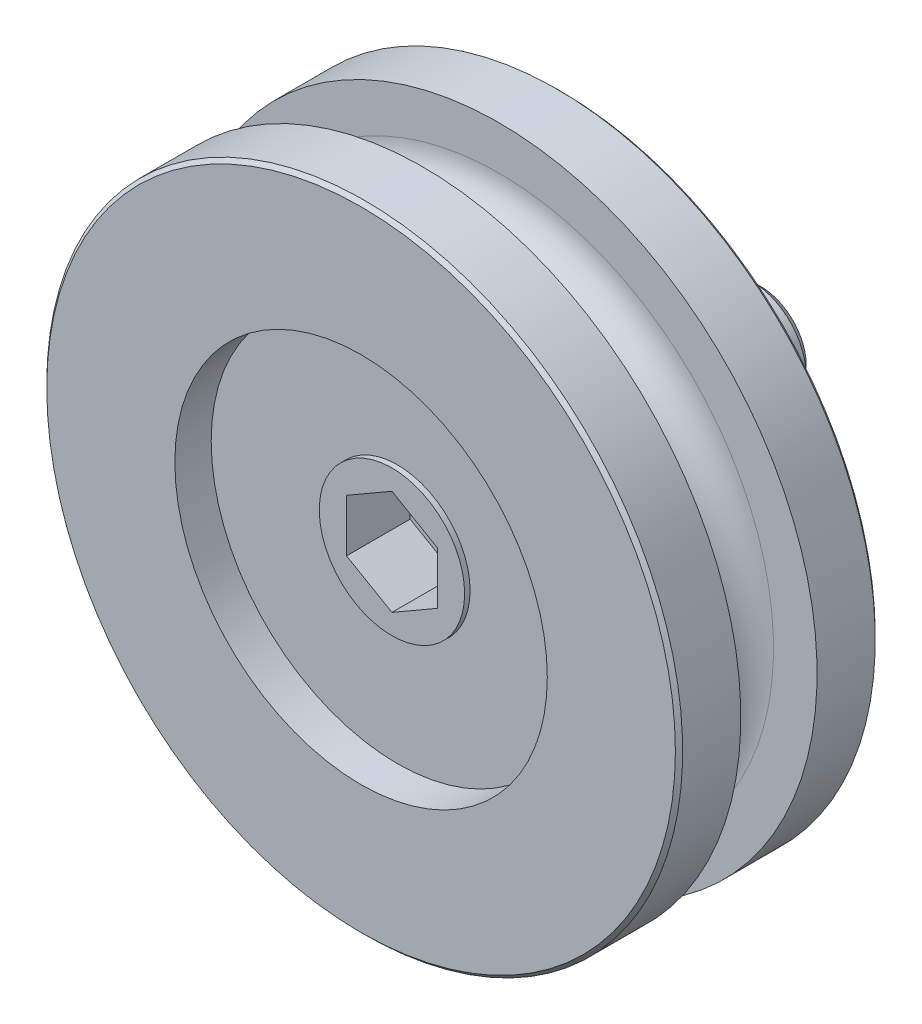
ISO-10303-21;
HEADER;
FILE_DESCRIPTION(('STEP AP214'),'2;1');
FILE_NAME('part.step','',(''),(''),'','','');
FILE_SCHEMA(('AUTOMOTIVE_DESIGN { 1 0 10303 214 1 1 1 1 }'));
ENDSEC;
DATA;
#1=APPLICATION_CONTEXT('core data for automotive mechanical design processes');
#2=APPLICATION_PROTOCOL_DEFINITION('international standard','automotive_design',2000,#1);
#3=PRODUCT_CONTEXT('',#1,'mechanical');
#4=PRODUCT('Part','Part','',(#3));
#5=PRODUCT_RELATED_PRODUCT_CATEGORY('part','',(#4));
#6=PRODUCT_DEFINITION_FORMATION('','',#4);
#7=PRODUCT_DEFINITION_CONTEXT('part definition',#1,'design');
#8=PRODUCT_DEFINITION('design','',#6,#7);
#9=PRODUCT_DEFINITION_SHAPE('','',#8);
#10=(LENGTH_UNIT() NAMED_UNIT(*) SI_UNIT(.MILLI.,.METRE.));
#11=(NAMED_UNIT(*) PLANE_ANGLE_UNIT() SI_UNIT($,.RADIAN.));
#12=(NAMED_UNIT(*) SI_UNIT($,.STERADIAN.) SOLID_ANGLE_UNIT());
#13=UNCERTAINTY_MEASURE_WITH_UNIT(LENGTH_MEASURE(1.E-05),#10,'distance_accuracy_value','');
#14=(GEOMETRIC_REPRESENTATION_CONTEXT(3) GLOBAL_UNCERTAINTY_ASSIGNED_CONTEXT((#13)) GLOBAL_UNIT_ASSIGNED_CONTEXT((#10,
#11,#12)) REPRESENTATION_CONTEXT('',''));
#15=CARTESIAN_POINT('',(0.,0.,0.));
#16=DIRECTION('',(0.,0.,1.));
#17=DIRECTION('',(1.,0.,0.));
#18=AXIS2_PLACEMENT_3D('',#15,#16,#17);
#19=CARTESIAN_POINT('',(0.,5.1,3.));
#20=DIRECTION('',(0.,0.,-1.));
#21=DIRECTION('',(-1.,0.,0.));
#22=AXIS2_PLACEMENT_3D('',#19,#20,#21);
#23=PLANE('',#22);
#24=CARTESIAN_POINT('',(2.4,-9.28614557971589,3.));
#25=DIRECTION('',(0.,0.,1.));
#26=DIRECTION('',(1.,0.,0.));
#27=AXIS2_PLACEMENT_3D('',#24,#25,#26);
#28=CIRCLE('',#27,1.);
#29=CARTESIAN_POINT('',(3.4,-9.28614557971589,3.));
#30=VERTEX_POINT('',#29);
#31=EDGE_CURVE('E142',#30,#30,#28,.T.);
#32=ORIENTED_EDGE('',*,*,#31,.F.);
#33=EDGE_LOOP('',(#32));
#34=FACE_BOUND('',#33,.T.);
#35=ADVANCED_FACE('F14',(#34),#23,.T.);
#36=CARTESIAN_POINT('',(-2.4,-9.28614557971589,3.));
#37=DIRECTION('',(0.,0.,-1.));
#38=DIRECTION('',(1.,0.,0.));
#39=AXIS2_PLACEMENT_3D('',#36,#37,#38);
#40=CIRCLE('',#39,1.);
#41=CARTESIAN_POINT('',(-1.4,-9.28614557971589,3.));
#42=VERTEX_POINT('',#41);
#43=EDGE_CURVE('E477',#42,#42,#40,.T.);
#44=ORIENTED_EDGE('',*,*,#43,.T.);
#45=EDGE_LOOP('',(#44));
#46=FACE_BOUND('',#45,.T.);
#47=ADVANCED_FACE('F269',(#46),#23,.T.);
#48=CARTESIAN_POINT('',(0.,0.,6.8));
#49=DIRECTION('',(0.,0.,1.));
#50=DIRECTION('',(1.,0.,0.));
#51=AXIS2_PLACEMENT_3D('',#48,#49,#50);
#52=PLANE('',#51);
#53=DIRECTION('',(-0.866025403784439,0.5,0.));
#54=VECTOR('',#53,1.);
#55=CARTESIAN_POINT('',(2.5,1.44337567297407,6.8));
#56=LINE('',#55,#54);
#57=CARTESIAN_POINT('',(2.5,1.44337567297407,6.8));
#58=VERTEX_POINT('',#57);
#59=CARTESIAN_POINT('',(0.,2.88675134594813,6.8));
#60=VERTEX_POINT('',#59);
#61=EDGE_CURVE('E79',#58,#60,#56,.T.);
#62=ORIENTED_EDGE('',*,*,#61,.T.);
#63=DIRECTION('',(-0.866025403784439,-0.5,0.));
#64=VECTOR('',#63,1.);
#65=CARTESIAN_POINT('',(0.,2.88675134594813,6.8));
#66=LINE('',#65,#64);
#67=CARTESIAN_POINT('',(-2.5,1.44337567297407,6.8));
#68=VERTEX_POINT('',#67);
#69=EDGE_CURVE('E219',#60,#68,#66,.T.);
#70=ORIENTED_EDGE('',*,*,#69,.T.);
#71=DIRECTION('',(0.,-1.,0.));
#72=VECTOR('',#71,1.);
#73=CARTESIAN_POINT('',(-2.5,1.44337567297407,6.8));
#74=LINE('',#73,#72);
#75=CARTESIAN_POINT('',(-2.5,-1.44337567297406,6.8));
#76=VERTEX_POINT('',#75);
#77=EDGE_CURVE('E222',#68,#76,#74,.T.);
#78=ORIENTED_EDGE('',*,*,#77,.T.);
#79=DIRECTION('',(0.866025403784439,-0.5,0.));
#80=VECTOR('',#79,1.);
#81=CARTESIAN_POINT('',(-2.5,-1.44337567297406,6.8));
#82=LINE('',#81,#80);
#83=CARTESIAN_POINT('',(0.,-2.88675134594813,6.8));
#84=VERTEX_POINT('',#83);
#85=EDGE_CURVE('E225',#76,#84,#82,.T.);
#86=ORIENTED_EDGE('',*,*,#85,.T.);
#87=DIRECTION('',(0.866025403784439,0.5,0.));
#88=VECTOR('',#87,1.);
#89=CARTESIAN_POINT('',(0.,-2.88675134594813,6.8));
#90=LINE('',#89,#88);
#91=CARTESIAN_POINT('',(2.5,-1.44337567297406,6.8));
#92=VERTEX_POINT('',#91);
#93=EDGE_CURVE('E227',#84,#92,#90,.T.);
#94=ORIENTED_EDGE('',*,*,#93,.T.);
#95=DIRECTION('',(0.,1.,0.));
#96=VECTOR('',#95,1.);
#97=CARTESIAN_POINT('',(2.5,-1.44337567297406,6.8));
#98=LINE('',#97,#96);
#99=EDGE_CURVE('E108',#92,#58,#98,.T.);
#100=ORIENTED_EDGE('',*,*,#99,.T.);
#101=EDGE_LOOP('',(#62,#70,#78,#86,#94,#100));
#102=FACE_BOUND('',#101,.T.);
#103=ADVANCED_FACE('F231',(#102),#52,.T.);
#104=CARTESIAN_POINT('',(0.,2.88675134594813,6.8));
#105=DIRECTION('',(-0.5,0.866025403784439,0.));
#106=DIRECTION('',(-0.866025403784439,-0.5,0.));
#107=AXIS2_PLACEMENT_3D('',#104,#105,#106);
#108=PLANE('',#107);
#109=DIRECTION('',(-0.866025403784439,-0.5,0.));
#110=VECTOR('',#109,1.);
#111=CARTESIAN_POINT('',(0.,2.88675134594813,10.3));
#112=LINE('',#111,#110);
#113=CARTESIAN_POINT('',(0.,2.88675134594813,10.3));
#114=VERTEX_POINT('',#113);
#115=CARTESIAN_POINT('',(-2.5,1.44337567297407,10.3));
#116=VERTEX_POINT('',#115);
#117=EDGE_CURVE('E99',#114,#116,#112,.T.);
#118=ORIENTED_EDGE('',*,*,#117,.T.);
#119=DIRECTION('',(0.,0.,1.));
#120=VECTOR('',#119,1.);
#121=CARTESIAN_POINT('',(-2.5,1.44337567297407,6.8));
#122=LINE('',#121,#120);
#123=EDGE_CURVE('E122',#68,#116,#122,.T.);
#124=ORIENTED_EDGE('',*,*,#123,.F.);
#125=ORIENTED_EDGE('',*,*,#69,.F.);
#126=DIRECTION('',(0.,0.,1.));
#127=VECTOR('',#126,1.);
#128=CARTESIAN_POINT('',(0.,2.88675134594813,6.8));
#129=LINE('',#128,#127);
#130=EDGE_CURVE('E124',#60,#114,#129,.T.);
#131=ORIENTED_EDGE('',*,*,#130,.T.);
#132=EDGE_LOOP('',(#118,#124,#125,#131));
#133=FACE_BOUND('',#132,.T.);
#134=ADVANCED_FACE('F235',(#133),#108,.F.);
#135=CARTESIAN_POINT('',(-2.5,1.44337567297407,6.8));
#136=DIRECTION('',(-1.,0.,0.));
#137=DIRECTION('',(0.,-1.,0.));
#138=AXIS2_PLACEMENT_3D('',#135,#136,#137);
#139=PLANE('',#138);
#140=DIRECTION('',(0.,-1.,0.));
#141=VECTOR('',#140,1.);
#142=CARTESIAN_POINT('',(-2.5,1.44337567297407,10.3));
#143=LINE('',#142,#141);
#144=CARTESIAN_POINT('',(-2.5,-1.44337567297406,10.3));
#145=VERTEX_POINT('',#144);
#146=EDGE_CURVE('E102',#116,#145,#143,.T.);
#147=ORIENTED_EDGE('',*,*,#146,.T.);
#148=DIRECTION('',(0.,0.,1.));
#149=VECTOR('',#148,1.);
#150=CARTESIAN_POINT('',(-2.5,-1.44337567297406,6.8));
#151=LINE('',#150,#149);
#152=EDGE_CURVE('E120',#76,#145,#151,.T.);
#153=ORIENTED_EDGE('',*,*,#152,.F.);
#154=ORIENTED_EDGE('',*,*,#77,.F.);
#155=ORIENTED_EDGE('',*,*,#123,.T.);
#156=EDGE_LOOP('',(#147,#153,#154,#155));
#157=FACE_BOUND('',#156,.T.);
#158=ADVANCED_FACE('F237',(#157),#139,.F.);
#159=CARTESIAN_POINT('',(-2.5,-1.44337567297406,6.8));
#160=DIRECTION('',(-0.5,-0.866025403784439,0.));
#161=DIRECTION('',(0.866025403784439,-0.5,0.));
#162=AXIS2_PLACEMENT_3D('',#159,#160,#161);
#163=PLANE('',#162);
#164=DIRECTION('',(0.866025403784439,-0.5,0.));
#165=VECTOR('',#164,1.);
#166=CARTESIAN_POINT('',(-2.5,-1.44337567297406,10.3));
#167=LINE('',#166,#165);
#168=CARTESIAN_POINT('',(0.,-2.88675134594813,10.3));
#169=VERTEX_POINT('',#168);
#170=EDGE_CURVE('E113',#145,#169,#167,.T.);
#171=ORIENTED_EDGE('',*,*,#170,.T.);
#172=DIRECTION('',(0.,0.,1.));
#173=VECTOR('',#172,1.);
#174=CARTESIAN_POINT('',(0.,-2.88675134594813,6.8));
#175=LINE('',#174,#173);
#176=EDGE_CURVE('E118',#84,#169,#175,.T.);
#177=ORIENTED_EDGE('',*,*,#176,.F.);
#178=ORIENTED_EDGE('',*,*,#85,.F.);
#179=ORIENTED_EDGE('',*,*,#152,.T.);
#180=EDGE_LOOP('',(#171,#177,#178,#179));
#181=FACE_BOUND('',#180,.T.);
#182=ADVANCED_FACE('F241',(#181),#163,.F.);
#183=CARTESIAN_POINT('',(0.,-2.88675134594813,6.8));
#184=DIRECTION('',(0.5,-0.866025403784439,0.));
#185=DIRECTION('',(0.866025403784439,0.5,0.));
#186=AXIS2_PLACEMENT_3D('',#183,#184,#185);
#187=PLANE('',#186);
#188=DIRECTION('',(0.866025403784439,0.5,0.));
#189=VECTOR('',#188,1.);
#190=CARTESIAN_POINT('',(0.,-2.88675134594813,10.3));
#191=LINE('',#190,#189);
#192=CARTESIAN_POINT('',(2.5,-1.44337567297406,10.3));
#193=VERTEX_POINT('',#192);
#194=EDGE_CURVE('E92',#169,#193,#191,.T.);
#195=ORIENTED_EDGE('',*,*,#194,.T.);
#196=DIRECTION('',(0.,0.,1.));
#197=VECTOR('',#196,1.);
#198=CARTESIAN_POINT('',(2.5,-1.44337567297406,6.8));
#199=LINE('',#198,#197);
#200=EDGE_CURVE('E84',#92,#193,#199,.T.);
#201=ORIENTED_EDGE('',*,*,#200,.F.);
#202=ORIENTED_EDGE('',*,*,#93,.F.);
#203=ORIENTED_EDGE('',*,*,#176,.T.);
#204=EDGE_LOOP('',(#195,#201,#202,#203));
#205=FACE_BOUND('',#204,.T.);
#206=ADVANCED_FACE('F243',(#205),#187,.F.);
#207=CARTESIAN_POINT('',(2.5,-1.44337567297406,6.8));
#208=DIRECTION('',(1.,0.,0.));
#209=DIRECTION('',(0.,0.,-1.));
#210=AXIS2_PLACEMENT_3D('',#207,#208,#209);
#211=PLANE('',#210);
#212=DIRECTION('',(0.,1.,0.));
#213=VECTOR('',#212,1.);
#214=CARTESIAN_POINT('',(2.5,-1.44337567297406,10.3));
#215=LINE('',#214,#213);
#216=CARTESIAN_POINT('',(2.5,1.44337567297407,10.3));
#217=VERTEX_POINT('',#216);
#218=EDGE_CURVE('E87',#193,#217,#215,.T.);
#219=ORIENTED_EDGE('',*,*,#218,.T.);
#220=DIRECTION('',(0.,0.,1.));
#221=VECTOR('',#220,1.);
#222=CARTESIAN_POINT('',(2.5,1.44337567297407,6.8));
#223=LINE('',#222,#221);
#224=EDGE_CURVE('E72',#58,#217,#223,.T.);
#225=ORIENTED_EDGE('',*,*,#224,.F.);
#226=ORIENTED_EDGE('',*,*,#99,.F.);
#227=ORIENTED_EDGE('',*,*,#200,.T.);
#228=EDGE_LOOP('',(#219,#225,#226,#227));
#229=FACE_BOUND('',#228,.T.);
#230=ADVANCED_FACE('F88',(#229),#211,.F.);
#231=CARTESIAN_POINT('',(2.5,1.44337567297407,6.8));
#232=DIRECTION('',(0.5,0.866025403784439,0.));
#233=DIRECTION('',(-0.866025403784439,0.5,0.));
#234=AXIS2_PLACEMENT_3D('',#231,#232,#233);
#235=PLANE('',#234);
#236=DIRECTION('',(-0.866025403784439,0.5,0.));
#237=VECTOR('',#236,1.);
#238=CARTESIAN_POINT('',(2.5,1.44337567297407,10.3));
#239=LINE('',#238,#237);
#240=EDGE_CURVE('E76',#217,#114,#239,.T.);
#241=ORIENTED_EDGE('',*,*,#240,.T.);
#242=ORIENTED_EDGE('',*,*,#130,.F.);
#243=ORIENTED_EDGE('',*,*,#61,.F.);
#244=ORIENTED_EDGE('',*,*,#224,.T.);
#245=EDGE_LOOP('',(#241,#242,#243,#244));
#246=FACE_BOUND('',#245,.T.);
#247=ADVANCED_FACE('F74',(#246),#235,.F.);
#248=CARTESIAN_POINT('',(0.,4.0000000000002,10.3));
#249=DIRECTION('',(0.,0.,1.));
#250=DIRECTION('',(1.,0.,0.));
#251=AXIS2_PLACEMENT_3D('',#248,#249,#250);
#252=PLANE('',#251);
#253=ORIENTED_EDGE('',*,*,#240,.F.);
#254=ORIENTED_EDGE('',*,*,#218,.F.);
#255=ORIENTED_EDGE('',*,*,#194,.F.);
#256=ORIENTED_EDGE('',*,*,#170,.F.);
#257=ORIENTED_EDGE('',*,*,#146,.F.);
#258=ORIENTED_EDGE('',*,*,#117,.F.);
#259=EDGE_LOOP('',(#253,#254,#255,#256,#257,#258));
#260=FACE_BOUND('',#259,.T.);
#261=CARTESIAN_POINT('',(0.,0.,10.3));
#262=DIRECTION('',(0.,0.,1.));
#263=DIRECTION('',(1.,0.,0.));
#264=AXIS2_PLACEMENT_3D('',#261,#262,#263);
#265=CIRCLE('',#264,4.0000000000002);
#266=CARTESIAN_POINT('',(4.0000000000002,0.,10.3));
#267=VERTEX_POINT('',#266);
#268=EDGE_CURVE('E128',#267,#267,#265,.T.);
#269=ORIENTED_EDGE('',*,*,#268,.T.);
#270=EDGE_LOOP('',(#269));
#271=FACE_BOUND('',#270,.T.);
#272=ADVANCED_FACE('F95',(#260,#271),#252,.T.);
#273=CARTESIAN_POINT('',(0.,0.,14.));
#274=DIRECTION('',(0.,0.,1.));
#275=DIRECTION('',(1.,0.,0.));
#276=AXIS2_PLACEMENT_3D('',#273,#274,#275);
#277=CYLINDRICAL_SURFACE('',#276,4.0000000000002);
#278=CARTESIAN_POINT('',(0.,0.,9.99999999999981));
#279=DIRECTION('',(0.,0.,1.));
#280=DIRECTION('',(1.,0.,0.));
#281=AXIS2_PLACEMENT_3D('',#278,#279,#280);
#282=CIRCLE('',#281,4.0000000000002);
#283=CARTESIAN_POINT('',(4.0000000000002,0.,9.99999999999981));
#284=VERTEX_POINT('',#283);
#285=EDGE_CURVE('E131',#284,#284,#282,.T.);
#286=ORIENTED_EDGE('',*,*,#285,.T.);
#287=EDGE_LOOP('',(#286));
#288=FACE_BOUND('',#287,.T.);
#289=ORIENTED_EDGE('',*,*,#268,.F.);
#290=EDGE_LOOP('',(#289));
#291=FACE_BOUND('',#290,.T.);
#292=ADVANCED_FACE('F394',(#288,#291),#277,.T.);
#293=CARTESIAN_POINT('',(0.,10.25,10.));
#294=DIRECTION('',(0.,0.,1.));
#295=DIRECTION('',(1.,0.,0.));
#296=AXIS2_PLACEMENT_3D('',#293,#294,#295);
#297=PLANE('',#296);
#298=CARTESIAN_POINT('',(0.,0.,10.));
#299=DIRECTION('',(0.,0.,1.));
#300=DIRECTION('',(1.,0.,0.));
#301=AXIS2_PLACEMENT_3D('',#298,#299,#300);
#302=CIRCLE('',#301,10.25);
#303=CARTESIAN_POINT('',(10.25,0.,10.));
#304=VERTEX_POINT('',#303);
#305=EDGE_CURVE('E100',#304,#304,#302,.F.);
#306=ORIENTED_EDGE('',*,*,#305,.F.);
#307=EDGE_LOOP('',(#306));
#308=FACE_BOUND('',#307,.T.);
#309=ORIENTED_EDGE('',*,*,#285,.F.);
#310=EDGE_LOOP('',(#309));
#311=FACE_BOUND('',#310,.T.);
#312=ADVANCED_FACE('F364',(#308,#311),#297,.T.);
#313=CARTESIAN_POINT('',(0.,0.,3.));
#314=DIRECTION('',(0.,0.,-1.));
#315=DIRECTION('',(-1.,0.,0.));
#316=AXIS2_PLACEMENT_3D('',#313,#314,#315);
#317=CYLINDRICAL_SURFACE('',#316,10.25);
#318=ORIENTED_EDGE('',*,*,#305,.T.);
#319=EDGE_LOOP('',(#318));
#320=FACE_BOUND('',#319,.T.);
#321=CARTESIAN_POINT('',(0.,0.,12.));
#322=DIRECTION('',(0.,0.,-1.));
#323=DIRECTION('',(-1.,0.,0.));
#324=AXIS2_PLACEMENT_3D('',#321,#322,#323);
#325=CIRCLE('',#324,10.25);
#326=CARTESIAN_POINT('',(-10.25,0.,12.));
#327=VERTEX_POINT('',#326);
#328=EDGE_CURVE('E105',#327,#327,#325,.T.);
#329=ORIENTED_EDGE('',*,*,#328,.F.);
#330=EDGE_LOOP('',(#329));
#331=FACE_BOUND('',#330,.T.);
#332=ADVANCED_FACE('F361',(#320,#331),#317,.F.);
#333=CARTESIAN_POINT('',(0.,10.25,12.));
#334=DIRECTION('',(0.,0.,1.));
#335=DIRECTION('',(1.,0.,0.));
#336=AXIS2_PLACEMENT_3D('',#333,#334,#335);
#337=PLANE('',#336);
#338=ORIENTED_EDGE('',*,*,#328,.T.);
#339=EDGE_LOOP('',(#338));
#340=FACE_BOUND('',#339,.T.);
#341=CARTESIAN_POINT('',(0.,0.,12.));
#342=DIRECTION('',(0.,0.,-1.));
#343=DIRECTION('',(-1.,0.,0.));
#344=AXIS2_PLACEMENT_3D('',#341,#342,#343);
#345=CIRCLE('',#344,17.3);
#346=CARTESIAN_POINT('',(-17.3,0.,12.));
#347=VERTEX_POINT('',#346);
#348=EDGE_CURVE('E181',#347,#347,#345,.T.);
#349=ORIENTED_EDGE('',*,*,#348,.F.);
#350=EDGE_LOOP('',(#349));
#351=FACE_BOUND('',#350,.T.);
#352=ADVANCED_FACE('F324',(#340,#351),#337,.T.);
#353=CARTESIAN_POINT('',(0.,0.,11.8));
#354=DIRECTION('',(0.,0.,-1.));
#355=DIRECTION('',(-1.,0.,0.));
#356=AXIS2_PLACEMENT_3D('',#353,#354,#355);
#357=CONICAL_SURFACE('',#356,17.5,0.785398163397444);
#358=ORIENTED_EDGE('',*,*,#348,.T.);
#359=EDGE_LOOP('',(#358));
#360=FACE_BOUND('',#359,.T.);
#361=CARTESIAN_POINT('',(0.,0.,11.8));
#362=DIRECTION('',(0.,0.,-1.));
#363=DIRECTION('',(-1.,0.,0.));
#364=AXIS2_PLACEMENT_3D('',#361,#362,#363);
#365=CIRCLE('',#364,17.5);
#366=CARTESIAN_POINT('',(-17.5,0.,11.8));
#367=VERTEX_POINT('',#366);
#368=EDGE_CURVE('E184',#367,#367,#365,.T.);
#369=ORIENTED_EDGE('',*,*,#368,.F.);
#370=EDGE_LOOP('',(#369));
#371=FACE_BOUND('',#370,.T.);
#372=ADVANCED_FACE('F320',(#360,#371),#357,.T.);
#373=CARTESIAN_POINT('',(0.,0.,3.));
#374=DIRECTION('',(0.,0.,-1.));
#375=DIRECTION('',(-1.,0.,0.));
#376=AXIS2_PLACEMENT_3D('',#373,#374,#375);
#377=CYLINDRICAL_SURFACE('',#376,17.5);
#378=ORIENTED_EDGE('',*,*,#368,.T.);
#379=EDGE_LOOP('',(#378));
#380=FACE_BOUND('',#379,.T.);
#381=CARTESIAN_POINT('',(0.,0.,8.6));
#382=DIRECTION('',(0.,0.,-1.));
#383=DIRECTION('',(-1.,0.,0.));
#384=AXIS2_PLACEMENT_3D('',#381,#382,#383);
#385=CIRCLE('',#384,17.5);
#386=CARTESIAN_POINT('',(-17.5,0.,8.6));
#387=VERTEX_POINT('',#386);
#388=EDGE_CURVE('E187',#387,#387,#385,.T.);
#389=ORIENTED_EDGE('',*,*,#388,.F.);
#390=EDGE_LOOP('',(#389));
#391=FACE_BOUND('',#390,.T.);
#392=ADVANCED_FACE('F323',(#380,#391),#377,.T.);
#393=CARTESIAN_POINT('',(0.,15.1,8.6));
#394=DIRECTION('',(0.,0.,-1.));
#395=DIRECTION('',(-1.,0.,0.));
#396=AXIS2_PLACEMENT_3D('',#393,#394,#395);
#397=PLANE('',#396);
#398=ORIENTED_EDGE('',*,*,#388,.T.);
#399=EDGE_LOOP('',(#398));
#400=FACE_BOUND('',#399,.T.);
#401=CARTESIAN_POINT('',(0.,0.,8.6));
#402=DIRECTION('',(0.,0.,-1.));
#403=DIRECTION('',(-1.,0.,0.));
#404=AXIS2_PLACEMENT_3D('',#401,#402,#403);
#405=CIRCLE('',#404,15.1);
#406=CARTESIAN_POINT('',(-15.1,0.,8.6));
#407=VERTEX_POINT('',#406);
#408=EDGE_CURVE('E190',#407,#407,#405,.T.);
#409=ORIENTED_EDGE('',*,*,#408,.F.);
#410=EDGE_LOOP('',(#409));
#411=FACE_BOUND('',#410,.T.);
#412=ADVANCED_FACE('F328',(#400,#411),#397,.T.);
#413=CARTESIAN_POINT('',(0.,0.,6.5));
#414=DIRECTION('',(0.,0.,-1.));
#415=DIRECTION('',(-1.,0.,0.));
#416=AXIS2_PLACEMENT_3D('',#413,#414,#415);
#417=TOROIDAL_SURFACE('',#416,15.1,2.1);
#418=ORIENTED_EDGE('',*,*,#408,.T.);
#419=EDGE_LOOP('',(#418));
#420=FACE_BOUND('',#419,.T.);
#421=CARTESIAN_POINT('',(0.,0.,4.4));
#422=DIRECTION('',(0.,0.,-1.));
#423=DIRECTION('',(-1.,0.,0.));
#424=AXIS2_PLACEMENT_3D('',#421,#422,#423);
#425=CIRCLE('',#424,15.1);
#426=CARTESIAN_POINT('',(-15.1,0.,4.4));
#427=VERTEX_POINT('',#426);
#428=EDGE_CURVE('E193',#427,#427,#425,.T.);
#429=ORIENTED_EDGE('',*,*,#428,.F.);
#430=EDGE_LOOP('',(#429));
#431=FACE_BOUND('',#430,.T.);
#432=ADVANCED_FACE('F307',(#420,#431),#417,.F.);
#433=CARTESIAN_POINT('',(0.,0.,-10.));
#434=DIRECTION('',(0.,0.,1.));
#435=DIRECTION('',(1.,0.,0.));
#436=AXIS2_PLACEMENT_3D('',#433,#434,#435);
#437=PLANE('',#436);
#438=CARTESIAN_POINT('',(0.,0.,-10.));
#439=DIRECTION('',(0.,0.,1.));
#440=DIRECTION('',(1.,0.,0.));
#441=AXIS2_PLACEMENT_3D('',#438,#439,#440);
#442=CIRCLE('',#441,2.5);
#443=CARTESIAN_POINT('',(2.5,0.,-10.));
#444=VERTEX_POINT('',#443);
#445=EDGE_CURVE('E140',#444,#444,#442,.F.);
#446=ORIENTED_EDGE('',*,*,#445,.T.);
#447=EDGE_LOOP('',(#446));
#448=FACE_BOUND('',#447,.T.);
#449=ADVANCED_FACE('F303',(#448),#437,.F.);
#450=CARTESIAN_POINT('',(0.,15.1,4.4));
#451=DIRECTION('',(0.,0.,1.));
#452=DIRECTION('',(1.,0.,0.));
#453=AXIS2_PLACEMENT_3D('',#450,#451,#452);
#454=PLANE('',#453);
#455=ORIENTED_EDGE('',*,*,#428,.T.);
#456=EDGE_LOOP('',(#455));
#457=FACE_BOUND('',#456,.T.);
#458=CARTESIAN_POINT('',(0.,0.,4.4));
#459=DIRECTION('',(0.,0.,-1.));
#460=DIRECTION('',(-1.,0.,0.));
#461=AXIS2_PLACEMENT_3D('',#458,#459,#460);
#462=CIRCLE('',#461,17.5);
#463=CARTESIAN_POINT('',(-17.5,0.,4.4));
#464=VERTEX_POINT('',#463);
#465=EDGE_CURVE('E196',#464,#464,#462,.T.);
#466=ORIENTED_EDGE('',*,*,#465,.F.);
#467=EDGE_LOOP('',(#466));
#468=FACE_BOUND('',#467,.T.);
#469=ADVANCED_FACE('F306',(#457,#468),#454,.T.);
#470=CARTESIAN_POINT('',(0.,0.,-9.5));
#471=DIRECTION('',(0.,0.,1.));
#472=DIRECTION('',(1.,0.,0.));
#473=AXIS2_PLACEMENT_3D('',#470,#471,#472);
#474=CONICAL_SURFACE('',#473,3.,0.785398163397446);
#475=ORIENTED_EDGE('',*,*,#445,.F.);
#476=EDGE_LOOP('',(#475));
#477=FACE_BOUND('',#476,.T.);
#478=CARTESIAN_POINT('',(0.,0.,-9.5));
#479=DIRECTION('',(0.,0.,1.));
#480=DIRECTION('',(1.,0.,0.));
#481=AXIS2_PLACEMENT_3D('',#478,#479,#480);
#482=CIRCLE('',#481,3.);
#483=CARTESIAN_POINT('',(3.,0.,-9.5));
#484=VERTEX_POINT('',#483);
#485=EDGE_CURVE('E137',#484,#484,#482,.T.);
#486=ORIENTED_EDGE('',*,*,#485,.F.);
#487=EDGE_LOOP('',(#486));
#488=FACE_BOUND('',#487,.T.);
#489=ADVANCED_FACE('F16',(#477,#488),#474,.T.);
#490=CARTESIAN_POINT('',(0.,0.,3.));
#491=DIRECTION('',(0.,0.,-1.));
#492=DIRECTION('',(-1.,0.,0.));
#493=AXIS2_PLACEMENT_3D('',#490,#491,#492);
#494=CYLINDRICAL_SURFACE('',#493,17.5);
#495=ORIENTED_EDGE('',*,*,#465,.T.);
#496=EDGE_LOOP('',(#495));
#497=FACE_BOUND('',#496,.T.);
#498=CARTESIAN_POINT('',(0.,0.,1.2));
#499=DIRECTION('',(0.,0.,-1.));
#500=DIRECTION('',(-1.,0.,0.));
#501=AXIS2_PLACEMENT_3D('',#498,#499,#500);
#502=CIRCLE('',#501,17.5);
#503=CARTESIAN_POINT('',(-17.5,0.,1.2));
#504=VERTEX_POINT('',#503);
#505=EDGE_CURVE('E199',#504,#504,#502,.T.);
#506=ORIENTED_EDGE('',*,*,#505,.F.);
#507=EDGE_LOOP('',(#506));
#508=FACE_BOUND('',#507,.T.);
#509=ADVANCED_FACE('F339',(#497,#508),#494,.T.);
#510=CARTESIAN_POINT('',(0.,0.,14.));
#511=DIRECTION('',(0.,0.,1.));
#512=DIRECTION('',(1.,0.,0.));
#513=AXIS2_PLACEMENT_3D('',#510,#511,#512);
#514=CYLINDRICAL_SURFACE('',#513,3.);
#515=ORIENTED_EDGE('',*,*,#485,.T.);
#516=EDGE_LOOP('',(#515));
#517=FACE_BOUND('',#516,.T.);
#518=CARTESIAN_POINT('',(0.,0.,-2.));
#519=DIRECTION('',(0.,0.,1.));
#520=DIRECTION('',(1.,0.,0.));
#521=AXIS2_PLACEMENT_3D('',#518,#519,#520);
#522=CIRCLE('',#521,3.);
#523=CARTESIAN_POINT('',(3.,0.,-2.));
#524=VERTEX_POINT('',#523);
#525=EDGE_CURVE('E175',#524,#524,#522,.T.);
#526=ORIENTED_EDGE('',*,*,#525,.F.);
#527=EDGE_LOOP('',(#526));
#528=FACE_BOUND('',#527,.T.);
#529=ADVANCED_FACE('F342',(#517,#528),#514,.T.);
#530=CARTESIAN_POINT('',(0.,0.,1.));
#531=DIRECTION('',(0.,0.,1.));
#532=DIRECTION('',(1.,0.,0.));
#533=AXIS2_PLACEMENT_3D('',#530,#531,#532);
#534=CONICAL_SURFACE('',#533,17.3,0.785398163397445);
#535=ORIENTED_EDGE('',*,*,#505,.T.);
#536=EDGE_LOOP('',(#535));
#537=FACE_BOUND('',#536,.T.);
#538=CARTESIAN_POINT('',(0.,0.,1.));
#539=DIRECTION('',(0.,0.,-1.));
#540=DIRECTION('',(-1.,0.,0.));
#541=AXIS2_PLACEMENT_3D('',#538,#539,#540);
#542=CIRCLE('',#541,17.3);
#543=CARTESIAN_POINT('',(-17.3,0.,1.));
#544=VERTEX_POINT('',#543);
#545=EDGE_CURVE('E202',#544,#544,#542,.T.);
#546=ORIENTED_EDGE('',*,*,#545,.F.);
#547=EDGE_LOOP('',(#546));
#548=FACE_BOUND('',#547,.T.);
#549=ADVANCED_FACE('F312',(#537,#548),#534,.T.);
#550=CARTESIAN_POINT('',(0.,0.,-2.));
#551=DIRECTION('',(0.,0.,1.));
#552=DIRECTION('',(1.,0.,0.));
#553=AXIS2_PLACEMENT_3D('',#550,#551,#552);
#554=PLANE('',#553);
#555=CARTESIAN_POINT('',(0.,0.,-2.));
#556=DIRECTION('',(0.,0.,1.));
#557=DIRECTION('',(1.,0.,0.));
#558=AXIS2_PLACEMENT_3D('',#555,#556,#557);
#559=CIRCLE('',#558,2.35);
#560=CARTESIAN_POINT('',(2.35,0.,-2.));
#561=VERTEX_POINT('',#560);
#562=EDGE_CURVE('E172',#561,#561,#559,.T.);
#563=ORIENTED_EDGE('',*,*,#562,.F.);
#564=EDGE_LOOP('',(#563));
#565=FACE_BOUND('',#564,.T.);
#566=ORIENTED_EDGE('',*,*,#525,.T.);
#567=EDGE_LOOP('',(#566));
#568=FACE_BOUND('',#567,.T.);
#569=ADVANCED_FACE('F308',(#565,#568),#554,.T.);
#570=CARTESIAN_POINT('',(0.,17.3,1.));
#571=DIRECTION('',(0.,0.,-1.));
#572=DIRECTION('',(-1.,0.,0.));
#573=AXIS2_PLACEMENT_3D('',#570,#571,#572);
#574=PLANE('',#573);
#575=ORIENTED_EDGE('',*,*,#545,.T.);
#576=EDGE_LOOP('',(#575));
#577=FACE_BOUND('',#576,.T.);
#578=CARTESIAN_POINT('',(0.,0.,1.));
#579=DIRECTION('',(0.,0.,-1.));
#580=DIRECTION('',(-1.,0.,0.));
#581=AXIS2_PLACEMENT_3D('',#578,#579,#580);
#582=CIRCLE('',#581,11.);
#583=CARTESIAN_POINT('',(-11.,0.,1.));
#584=VERTEX_POINT('',#583);
#585=EDGE_CURVE('E205',#584,#584,#582,.T.);
#586=ORIENTED_EDGE('',*,*,#585,.F.);
#587=EDGE_LOOP('',(#586));
#588=FACE_BOUND('',#587,.T.);
#589=ADVANCED_FACE('F311',(#577,#588),#574,.T.);
#590=CARTESIAN_POINT('',(0.,0.,14.));
#591=DIRECTION('',(0.,0.,1.));
#592=DIRECTION('',(1.,0.,0.));
#593=AXIS2_PLACEMENT_3D('',#590,#591,#592);
#594=CYLINDRICAL_SURFACE('',#593,2.35);
#595=CARTESIAN_POINT('',(0.,0.,0.));
#596=DIRECTION('',(0.,0.,-1.));
#597=DIRECTION('',(-1.,0.,0.));
#598=AXIS2_PLACEMENT_3D('',#595,#596,#597);
#599=CIRCLE('',#598,2.35);
#600=CARTESIAN_POINT('',(-2.35,0.,0.));
#601=VERTEX_POINT('',#600);
#602=EDGE_CURVE('E134',#601,#601,#599,.F.);
#603=ORIENTED_EDGE('',*,*,#602,.F.);
#604=EDGE_LOOP('',(#603));
#605=FACE_BOUND('',#604,.T.);
#606=ORIENTED_EDGE('',*,*,#562,.T.);
#607=EDGE_LOOP('',(#606));
#608=FACE_BOUND('',#607,.T.);
#609=ADVANCED_FACE('F349',(#605,#608),#594,.T.);
#610=CARTESIAN_POINT('',(0.,0.,3.));
#611=DIRECTION('',(0.,0.,-1.));
#612=DIRECTION('',(-1.,0.,0.));
#613=AXIS2_PLACEMENT_3D('',#610,#611,#612);
#614=CYLINDRICAL_SURFACE('',#613,11.);
#615=ORIENTED_EDGE('',*,*,#585,.T.);
#616=EDGE_LOOP('',(#615));
#617=FACE_BOUND('',#616,.T.);
#618=CARTESIAN_POINT('',(0.,0.,1.85));
#619=DIRECTION('',(0.,0.,-1.));
#620=DIRECTION('',(-1.,0.,0.));
#621=AXIS2_PLACEMENT_3D('',#618,#619,#620);
#622=CIRCLE('',#621,11.);
#623=CARTESIAN_POINT('',(-11.,0.,1.85));
#624=VERTEX_POINT('',#623);
#625=EDGE_CURVE('E208',#624,#624,#622,.T.);
#626=ORIENTED_EDGE('',*,*,#625,.F.);
#627=EDGE_LOOP('',(#626));
#628=FACE_BOUND('',#627,.T.);
#629=ADVANCED_FACE('F318',(#617,#628),#614,.F.);
#630=CARTESIAN_POINT('',(0.,0.,0.));
#631=DIRECTION('',(0.,0.,-1.));
#632=DIRECTION('',(-1.,0.,0.));
#633=AXIS2_PLACEMENT_3D('',#630,#631,#632);
#634=PLANE('',#633);
#635=ORIENTED_EDGE('',*,*,#602,.T.);
#636=EDGE_LOOP('',(#635));
#637=FACE_BOUND('',#636,.T.);
#638=CARTESIAN_POINT('',(0.,0.,0.));
#639=DIRECTION('',(0.,0.,-1.));
#640=DIRECTION('',(-1.,0.,0.));
#641=AXIS2_PLACEMENT_3D('',#638,#639,#640);
#642=CIRCLE('',#641,5.1);
#643=CARTESIAN_POINT('',(-5.1,0.,0.));
#644=VERTEX_POINT('',#643);
#645=EDGE_CURVE('E178',#644,#644,#642,.T.);
#646=ORIENTED_EDGE('',*,*,#645,.T.);
#647=EDGE_LOOP('',(#646));
#648=FACE_BOUND('',#647,.T.);
#649=ADVANCED_FACE('F314',(#637,#648),#634,.T.);
#650=CARTESIAN_POINT('',(0.,11.,1.85));
#651=DIRECTION('',(0.,0.,1.));
#652=DIRECTION('',(1.,0.,0.));
#653=AXIS2_PLACEMENT_3D('',#650,#651,#652);
#654=PLANE('',#653);
#655=ORIENTED_EDGE('',*,*,#625,.T.);
#656=EDGE_LOOP('',(#655));
#657=FACE_BOUND('',#656,.T.);
#658=CARTESIAN_POINT('',(0.,0.,1.85));
#659=DIRECTION('',(0.,0.,-1.));
#660=DIRECTION('',(-1.,0.,0.));
#661=AXIS2_PLACEMENT_3D('',#658,#659,#660);
#662=CIRCLE('',#661,11.5);
#663=CARTESIAN_POINT('',(-11.5,0.,1.85));
#664=VERTEX_POINT('',#663);
#665=EDGE_CURVE('E211',#664,#664,#662,.T.);
#666=ORIENTED_EDGE('',*,*,#665,.F.);
#667=EDGE_LOOP('',(#666));
#668=FACE_BOUND('',#667,.T.);
#669=ADVANCED_FACE('F317',(#657,#668),#654,.T.);
#670=CARTESIAN_POINT('',(0.,0.,3.));
#671=DIRECTION('',(0.,0.,-1.));
#672=DIRECTION('',(-1.,0.,0.));
#673=AXIS2_PLACEMENT_3D('',#670,#671,#672);
#674=CYLINDRICAL_SURFACE('',#673,11.5);
#675=ORIENTED_EDGE('',*,*,#665,.T.);
#676=EDGE_LOOP('',(#675));
#677=FACE_BOUND('',#676,.T.);
#678=DIRECTION('',(0.,0.,-1.));
#679=VECTOR('',#678,1.);
#680=CARTESIAN_POINT('',(1.16498191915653,-11.440839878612,3.));
#681=LINE('',#680,#679);
#682=CARTESIAN_POINT('',(1.16498191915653,-11.440839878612,2.));
#683=VERTEX_POINT('',#682);
#684=CARTESIAN_POINT('',(1.16498191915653,-11.440839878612,3.));
#685=VERTEX_POINT('',#684);
#686=EDGE_CURVE('E18',#683,#685,#681,.F.);
#687=ORIENTED_EDGE('',*,*,#686,.F.);
#688=CARTESIAN_POINT('',(0.,0.,2.));
#689=DIRECTION('',(0.,0.,-1.));
#690=DIRECTION('',(-1.,0.,0.));
#691=AXIS2_PLACEMENT_3D('',#688,#689,#690);
#692=CIRCLE('',#691,11.5);
#693=CARTESIAN_POINT('',(-1.16498191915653,-11.440839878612,2.));
#694=VERTEX_POINT('',#693);
#695=EDGE_CURVE('E9',#683,#694,#692,.F.);
#696=ORIENTED_EDGE('',*,*,#695,.T.);
#697=DIRECTION('',(0.,0.,-1.));
#698=VECTOR('',#697,1.);
#699=CARTESIAN_POINT('',(-1.16498191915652,-11.440839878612,3.));
#700=LINE('',#699,#698);
#701=CARTESIAN_POINT('',(-1.16498191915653,-11.440839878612,3.));
#702=VERTEX_POINT('',#701);
#703=EDGE_CURVE('E168',#702,#694,#700,.T.);
#704=ORIENTED_EDGE('',*,*,#703,.F.);
#705=CARTESIAN_POINT('',(0.,0.,3.));
#706=DIRECTION('',(0.,0.,-1.));
#707=DIRECTION('',(-1.,0.,0.));
#708=AXIS2_PLACEMENT_3D('',#705,#706,#707);
#709=CIRCLE('',#708,11.5);
#710=EDGE_CURVE('E214',#685,#702,#709,.T.);
#711=ORIENTED_EDGE('',*,*,#710,.F.);
#712=EDGE_LOOP('',(#687,#696,#704,#711));
#713=FACE_BOUND('',#712,.T.);
#714=ADVANCED_FACE('F356',(#677,#713),#674,.F.);
#715=CARTESIAN_POINT('',(0.,0.,14.));
#716=DIRECTION('',(0.,0.,1.));
#717=DIRECTION('',(1.,0.,0.));
#718=AXIS2_PLACEMENT_3D('',#715,#716,#717);
#719=CYLINDRICAL_SURFACE('',#718,5.1);
#720=CARTESIAN_POINT('',(0.,0.,3.));
#721=DIRECTION('',(0.,0.,1.));
#722=DIRECTION('',(1.,0.,0.));
#723=AXIS2_PLACEMENT_3D('',#720,#721,#722);
#724=CIRCLE('',#723,5.1);
#725=CARTESIAN_POINT('',(5.1,0.,3.));
#726=VERTEX_POINT('',#725);
#727=EDGE_CURVE('E83',#726,#726,#724,.T.);
#728=ORIENTED_EDGE('',*,*,#727,.F.);
#729=EDGE_LOOP('',(#728));
#730=FACE_BOUND('',#729,.T.);
#731=ORIENTED_EDGE('',*,*,#645,.F.);
#732=EDGE_LOOP('',(#731));
#733=FACE_BOUND('',#732,.T.);
#734=ADVANCED_FACE('F266',(#730,#733),#719,.T.);
#735=ORIENTED_EDGE('',*,*,#727,.T.);
#736=EDGE_LOOP('',(#735));
#737=FACE_BOUND('',#736,.T.);
#738=DIRECTION('',(0.231349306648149,-0.972870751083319,0.));
#739=VECTOR('',#738,1.);
#740=CARTESIAN_POINT('',(0.746119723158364,-9.67943940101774,3.));
#741=LINE('',#740,#739);
#742=CARTESIAN_POINT('',(0.746119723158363,-9.67943940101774,3.));
#743=VERTEX_POINT('',#742);
#744=EDGE_CURVE('E31',#743,#685,#741,.T.);
#745=ORIENTED_EDGE('',*,*,#744,.T.);
#746=ORIENTED_EDGE('',*,*,#710,.T.);
#747=DIRECTION('',(0.231349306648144,0.97287075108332,0.));
#748=VECTOR('',#747,1.);
#749=CARTESIAN_POINT('',(-0.746119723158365,-9.67943940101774,3.));
#750=LINE('',#749,#748);
#751=CARTESIAN_POINT('',(-0.746119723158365,-9.67943940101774,3.));
#752=VERTEX_POINT('',#751);
#753=EDGE_CURVE('E473',#702,#752,#750,.T.);
#754=ORIENTED_EDGE('',*,*,#753,.T.);
#755=CARTESIAN_POINT('',(-2.4,-9.28614557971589,3.));
#756=DIRECTION('',(0.,0.,1.));
#757=DIRECTION('',(-1.,0.,0.));
#758=AXIS2_PLACEMENT_3D('',#755,#756,#757);
#759=CIRCLE('',#758,1.7);
#760=CARTESIAN_POINT('',(-3.29136923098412,-7.83857489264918,3.));
#761=VERTEX_POINT('',#760);
#762=EDGE_CURVE('E460',#752,#761,#759,.T.);
#763=ORIENTED_EDGE('',*,*,#762,.T.);
#764=DIRECTION('',(-0.851512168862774,-0.524334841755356,0.));
#765=VECTOR('',#764,1.);
#766=CARTESIAN_POINT('',(-3.29136923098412,-7.83857489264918,3.));
#767=LINE('',#766,#765);
#768=CARTESIAN_POINT('',(-5.24892182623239,-9.04397520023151,3.));
#769=VERTEX_POINT('',#768);
#770=EDGE_CURVE('E167',#761,#769,#767,.T.);
#771=ORIENTED_EDGE('',*,*,#770,.T.);
#772=CARTESIAN_POINT('',(0.,-0.65,3.));
#773=DIRECTION('',(0.,0.,-1.));
#774=DIRECTION('',(0.,-1.,0.));
#775=AXIS2_PLACEMENT_3D('',#772,#773,#774);
#776=CIRCLE('',#775,9.9);
#777=CARTESIAN_POINT('',(5.2489218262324,-9.04397520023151,3.));
#778=VERTEX_POINT('',#777);
#779=EDGE_CURVE('E485',#769,#778,#776,.T.);
#780=ORIENTED_EDGE('',*,*,#779,.T.);
#781=DIRECTION('',(-0.851512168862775,0.524334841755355,0.));
#782=VECTOR('',#781,1.);
#783=CARTESIAN_POINT('',(3.29136923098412,-7.83857489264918,3.));
#784=LINE('',#783,#782);
#785=CARTESIAN_POINT('',(3.29136923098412,-7.83857489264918,3.));
#786=VERTEX_POINT('',#785);
#787=EDGE_CURVE('E491',#778,#786,#784,.T.);
#788=ORIENTED_EDGE('',*,*,#787,.T.);
#789=CARTESIAN_POINT('',(2.4,-9.28614557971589,3.));
#790=DIRECTION('',(0.,0.,1.));
#791=DIRECTION('',(1.,0.,0.));
#792=AXIS2_PLACEMENT_3D('',#789,#790,#791);
#793=CIRCLE('',#792,1.7);
#794=EDGE_CURVE('E495',#786,#743,#793,.T.);
#795=ORIENTED_EDGE('',*,*,#794,.T.);
#796=EDGE_LOOP('',(#745,#746,#754,#763,#771,#780,#788,#795));
#797=FACE_BOUND('',#796,.T.);
#798=ADVANCED_FACE('F256',(#737,#797),#23,.T.);
#799=CARTESIAN_POINT('',(0.,-0.65,3.));
#800=DIRECTION('',(0.,0.,1.));
#801=DIRECTION('',(-1.,0.,0.));
#802=AXIS2_PLACEMENT_3D('',#799,#800,#801);
#803=CYLINDRICAL_SURFACE('',#802,9.9);
#804=CARTESIAN_POINT('',(0.,-0.65,2.));
#805=DIRECTION('',(0.,0.,-1.));
#806=DIRECTION('',(0.,-1.,0.));
#807=AXIS2_PLACEMENT_3D('',#804,#805,#806);
#808=CIRCLE('',#807,9.9);
#809=CARTESIAN_POINT('',(-5.24892182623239,-9.04397520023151,2.));
#810=VERTEX_POINT('',#809);
#811=CARTESIAN_POINT('',(5.2489218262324,-9.04397520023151,2.));
#812=VERTEX_POINT('',#811);
#813=EDGE_CURVE('E469',#810,#812,#808,.T.);
#814=ORIENTED_EDGE('',*,*,#813,.T.);
#815=DIRECTION('',(0.,0.,-1.));
#816=VECTOR('',#815,1.);
#817=CARTESIAN_POINT('',(5.2489218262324,-9.04397520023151,3.));
#818=LINE('',#817,#816);
#819=EDGE_CURVE('E163',#778,#812,#818,.T.);
#820=ORIENTED_EDGE('',*,*,#819,.F.);
#821=ORIENTED_EDGE('',*,*,#779,.F.);
#822=DIRECTION('',(0.,0.,-1.));
#823=VECTOR('',#822,1.);
#824=CARTESIAN_POINT('',(-5.24892182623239,-9.04397520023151,3.));
#825=LINE('',#824,#823);
#826=EDGE_CURVE('E471',#769,#810,#825,.T.);
#827=ORIENTED_EDGE('',*,*,#826,.T.);
#828=EDGE_LOOP('',(#814,#820,#821,#827));
#829=FACE_BOUND('',#828,.T.);
#830=ADVANCED_FACE('F253',(#829),#803,.F.);
#831=CARTESIAN_POINT('',(3.29136923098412,-7.83857489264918,3.));
#832=DIRECTION('',(-0.524334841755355,-0.851512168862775,0.));
#833=DIRECTION('',(-0.851512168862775,0.524334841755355,0.));
#834=AXIS2_PLACEMENT_3D('',#831,#832,#833);
#835=PLANE('',#834);
#836=DIRECTION('',(-0.851512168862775,0.524334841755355,0.));
#837=VECTOR('',#836,1.);
#838=CARTESIAN_POINT('',(3.29136923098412,-7.83857489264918,2.));
#839=LINE('',#838,#837);
#840=CARTESIAN_POINT('',(3.29136923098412,-7.83857489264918,2.));
#841=VERTEX_POINT('',#840);
#842=EDGE_CURVE('E166',#812,#841,#839,.T.);
#843=ORIENTED_EDGE('',*,*,#842,.T.);
#844=DIRECTION('',(0.,0.,-1.));
#845=VECTOR('',#844,1.);
#846=CARTESIAN_POINT('',(3.29136923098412,-7.83857489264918,3.));
#847=LINE('',#846,#845);
#848=EDGE_CURVE('E449',#786,#841,#847,.T.);
#849=ORIENTED_EDGE('',*,*,#848,.F.);
#850=ORIENTED_EDGE('',*,*,#787,.F.);
#851=ORIENTED_EDGE('',*,*,#819,.T.);
#852=EDGE_LOOP('',(#843,#849,#850,#851));
#853=FACE_BOUND('',#852,.T.);
#854=ADVANCED_FACE('F255',(#853),#835,.F.);
#855=CARTESIAN_POINT('',(2.4,-9.28614557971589,3.));
#856=DIRECTION('',(0.,0.,1.));
#857=DIRECTION('',(-1.,0.,0.));
#858=AXIS2_PLACEMENT_3D('',#855,#856,#857);
#859=CYLINDRICAL_SURFACE('',#858,1.7);
#860=CARTESIAN_POINT('',(2.4,-9.28614557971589,2.));
#861=DIRECTION('',(0.,0.,1.));
#862=DIRECTION('',(1.,0.,0.));
#863=AXIS2_PLACEMENT_3D('',#860,#861,#862);
#864=CIRCLE('',#863,1.7);
#865=CARTESIAN_POINT('',(0.746119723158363,-9.67943940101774,2.));
#866=VERTEX_POINT('',#865);
#867=EDGE_CURVE('E456',#841,#866,#864,.T.);
#868=ORIENTED_EDGE('',*,*,#867,.T.);
#869=DIRECTION('',(0.,0.,-1.));
#870=VECTOR('',#869,1.);
#871=CARTESIAN_POINT('',(0.746119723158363,-9.67943940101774,3.));
#872=LINE('',#871,#870);
#873=EDGE_CURVE('E161',#743,#866,#872,.T.);
#874=ORIENTED_EDGE('',*,*,#873,.F.);
#875=ORIENTED_EDGE('',*,*,#794,.F.);
#876=ORIENTED_EDGE('',*,*,#848,.T.);
#877=EDGE_LOOP('',(#868,#874,#875,#876));
#878=FACE_BOUND('',#877,.T.);
#879=ADVANCED_FACE('F263',(#878),#859,.T.);
#880=CARTESIAN_POINT('',(-0.746119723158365,-9.67943940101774,3.));
#881=DIRECTION('',(-0.97287075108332,0.231349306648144,0.));
#882=DIRECTION('',(0.,0.,1.));
#883=AXIS2_PLACEMENT_3D('',#880,#881,#882);
#884=PLANE('',#883);
#885=ORIENTED_EDGE('',*,*,#753,.F.);
#886=ORIENTED_EDGE('',*,*,#703,.T.);
#887=DIRECTION('',(0.231349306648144,0.97287075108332,0.));
#888=VECTOR('',#887,1.);
#889=CARTESIAN_POINT('',(-0.746119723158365,-9.67943940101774,2.));
#890=LINE('',#889,#888);
#891=CARTESIAN_POINT('',(-0.746119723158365,-9.67943940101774,2.));
#892=VERTEX_POINT('',#891);
#893=EDGE_CURVE('E445',#694,#892,#890,.T.);
#894=ORIENTED_EDGE('',*,*,#893,.T.);
#895=DIRECTION('',(0.,0.,-1.));
#896=VECTOR('',#895,1.);
#897=CARTESIAN_POINT('',(-0.746119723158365,-9.67943940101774,3.));
#898=LINE('',#897,#896);
#899=EDGE_CURVE('E157',#752,#892,#898,.T.);
#900=ORIENTED_EDGE('',*,*,#899,.F.);
#901=EDGE_LOOP('',(#885,#886,#894,#900));
#902=FACE_BOUND('',#901,.T.);
#903=ADVANCED_FACE('F292',(#902),#884,.F.);
#904=CARTESIAN_POINT('',(-3.29136923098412,-7.83857489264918,3.));
#905=DIRECTION('',(0.524334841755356,-0.851512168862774,0.));
#906=DIRECTION('',(0.,0.,-1.));
#907=AXIS2_PLACEMENT_3D('',#904,#905,#906);
#908=PLANE('',#907);
#909=DIRECTION('',(-0.851512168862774,-0.524334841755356,0.));
#910=VECTOR('',#909,1.);
#911=CARTESIAN_POINT('',(-3.29136923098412,-7.83857489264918,2.));
#912=LINE('',#911,#910);
#913=CARTESIAN_POINT('',(-3.29136923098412,-7.83857489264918,2.));
#914=VERTEX_POINT('',#913);
#915=EDGE_CURVE('E171',#914,#810,#912,.T.);
#916=ORIENTED_EDGE('',*,*,#915,.T.);
#917=ORIENTED_EDGE('',*,*,#826,.F.);
#918=ORIENTED_EDGE('',*,*,#770,.F.);
#919=DIRECTION('',(0.,0.,-1.));
#920=VECTOR('',#919,1.);
#921=CARTESIAN_POINT('',(-3.29136923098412,-7.83857489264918,3.));
#922=LINE('',#921,#920);
#923=EDGE_CURVE('E468',#761,#914,#922,.T.);
#924=ORIENTED_EDGE('',*,*,#923,.T.);
#925=EDGE_LOOP('',(#916,#917,#918,#924));
#926=FACE_BOUND('',#925,.T.);
#927=ADVANCED_FACE('F288',(#926),#908,.F.);
#928=CARTESIAN_POINT('',(0.,-0.65,2.));
#929=DIRECTION('',(0.,0.,-1.));
#930=DIRECTION('',(0.,-1.,0.));
#931=AXIS2_PLACEMENT_3D('',#928,#929,#930);
#932=PLANE('',#931);
#933=CARTESIAN_POINT('',(2.4,-9.28614557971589,2.));
#934=DIRECTION('',(0.,0.,1.));
#935=DIRECTION('',(1.,0.,0.));
#936=AXIS2_PLACEMENT_3D('',#933,#934,#935);
#937=CIRCLE('',#936,1.);
#938=CARTESIAN_POINT('',(3.4,-9.28614557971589,2.));
#939=VERTEX_POINT('',#938);
#940=EDGE_CURVE('E464',#939,#939,#937,.T.);
#941=ORIENTED_EDGE('',*,*,#940,.T.);
#942=EDGE_LOOP('',(#941));
#943=FACE_BOUND('',#942,.T.);
#944=CARTESIAN_POINT('',(-2.4,-9.28614557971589,2.));
#945=DIRECTION('',(0.,0.,-1.));
#946=DIRECTION('',(1.,0.,0.));
#947=AXIS2_PLACEMENT_3D('',#944,#945,#946);
#948=CIRCLE('',#947,1.);
#949=CARTESIAN_POINT('',(-1.4,-9.28614557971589,2.));
#950=VERTEX_POINT('',#949);
#951=EDGE_CURVE('E147',#950,#950,#948,.T.);
#952=ORIENTED_EDGE('',*,*,#951,.F.);
#953=EDGE_LOOP('',(#952));
#954=FACE_BOUND('',#953,.T.);
#955=ORIENTED_EDGE('',*,*,#695,.F.);
#956=DIRECTION('',(0.231349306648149,-0.972870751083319,0.));
#957=VECTOR('',#956,1.);
#958=CARTESIAN_POINT('',(0.746119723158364,-9.67943940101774,2.));
#959=LINE('',#958,#957);
#960=EDGE_CURVE('E441',#866,#683,#959,.T.);
#961=ORIENTED_EDGE('',*,*,#960,.F.);
#962=ORIENTED_EDGE('',*,*,#867,.F.);
#963=ORIENTED_EDGE('',*,*,#842,.F.);
#964=ORIENTED_EDGE('',*,*,#813,.F.);
#965=ORIENTED_EDGE('',*,*,#915,.F.);
#966=CARTESIAN_POINT('',(-2.4,-9.28614557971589,2.));
#967=DIRECTION('',(0.,0.,1.));
#968=DIRECTION('',(-1.,0.,0.));
#969=AXIS2_PLACEMENT_3D('',#966,#967,#968);
#970=CIRCLE('',#969,1.7);
#971=EDGE_CURVE('E461',#892,#914,#970,.T.);
#972=ORIENTED_EDGE('',*,*,#971,.F.);
#973=ORIENTED_EDGE('',*,*,#893,.F.);
#974=EDGE_LOOP('',(#955,#961,#962,#963,#964,#965,#972,#973));
#975=FACE_BOUND('',#974,.T.);
#976=ADVANCED_FACE('F280',(#943,#954,#975),#932,.T.);
#977=CARTESIAN_POINT('',(2.4,-9.28614557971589,3.));
#978=DIRECTION('',(0.,0.,1.));
#979=DIRECTION('',(-1.,0.,0.));
#980=AXIS2_PLACEMENT_3D('',#977,#978,#979);
#981=CYLINDRICAL_SURFACE('',#980,1.);
#982=ORIENTED_EDGE('',*,*,#940,.F.);
#983=EDGE_LOOP('',(#982));
#984=FACE_BOUND('',#983,.T.);
#985=ORIENTED_EDGE('',*,*,#31,.T.);
#986=EDGE_LOOP('',(#985));
#987=FACE_BOUND('',#986,.T.);
#988=ADVANCED_FACE('F276',(#984,#987),#981,.F.);
#989=CARTESIAN_POINT('',(-2.4,-9.28614557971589,3.));
#990=DIRECTION('',(0.,0.,1.));
#991=DIRECTION('',(-1.,0.,0.));
#992=AXIS2_PLACEMENT_3D('',#989,#990,#991);
#993=CYLINDRICAL_SURFACE('',#992,1.);
#994=ORIENTED_EDGE('',*,*,#951,.T.);
#995=EDGE_LOOP('',(#994));
#996=FACE_BOUND('',#995,.T.);
#997=ORIENTED_EDGE('',*,*,#43,.F.);
#998=EDGE_LOOP('',(#997));
#999=FACE_BOUND('',#998,.T.);
#1000=ADVANCED_FACE('F272',(#996,#999),#993,.F.);
#1001=CARTESIAN_POINT('',(-2.4,-9.28614557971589,3.));
#1002=DIRECTION('',(0.,0.,1.));
#1003=DIRECTION('',(-1.,0.,0.));
#1004=AXIS2_PLACEMENT_3D('',#1001,#1002,#1003);
#1005=CYLINDRICAL_SURFACE('',#1004,1.7);
#1006=ORIENTED_EDGE('',*,*,#971,.T.);
#1007=ORIENTED_EDGE('',*,*,#923,.F.);
#1008=ORIENTED_EDGE('',*,*,#762,.F.);
#1009=ORIENTED_EDGE('',*,*,#899,.T.);
#1010=EDGE_LOOP('',(#1006,#1007,#1008,#1009));
#1011=FACE_BOUND('',#1010,.T.);
#1012=ADVANCED_FACE('F275',(#1011),#1005,.T.);
#1013=CARTESIAN_POINT('',(0.746119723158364,-9.67943940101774,3.));
#1014=DIRECTION('',(0.972870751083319,0.231349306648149,0.));
#1015=DIRECTION('',(0.,0.,-1.));
#1016=AXIS2_PLACEMENT_3D('',#1013,#1014,#1015);
#1017=PLANE('',#1016);
#1018=ORIENTED_EDGE('',*,*,#960,.T.);
#1019=ORIENTED_EDGE('',*,*,#686,.T.);
#1020=ORIENTED_EDGE('',*,*,#744,.F.);
#1021=ORIENTED_EDGE('',*,*,#873,.T.);
#1022=EDGE_LOOP('',(#1018,#1019,#1020,#1021));
#1023=FACE_BOUND('',#1022,.T.);
#1024=ADVANCED_FACE('F284',(#1023),#1017,.F.);
#1025=CLOSED_SHELL('',(#35,#47,#103,#134,#158,#182,#206,#230,#247,#272,#292,#312,#332,#352,#372,
#392,#412,#432,#449,#469,#489,#509,#529,#549,#569,#589,#609,#629,#649,#669,#714,#734,#798,#830,
#854,#879,#903,#927,#976,#988,#1000,#1012,#1024));
#1026=MANIFOLD_SOLID_BREP('B1',#1025);
#1027=ADVANCED_BREP_SHAPE_REPRESENTATION('',(#18,#1026),#14);
#1028=SHAPE_DEFINITION_REPRESENTATION(#9,#1027);
ENDSEC;
END-ISO-10303-21;
